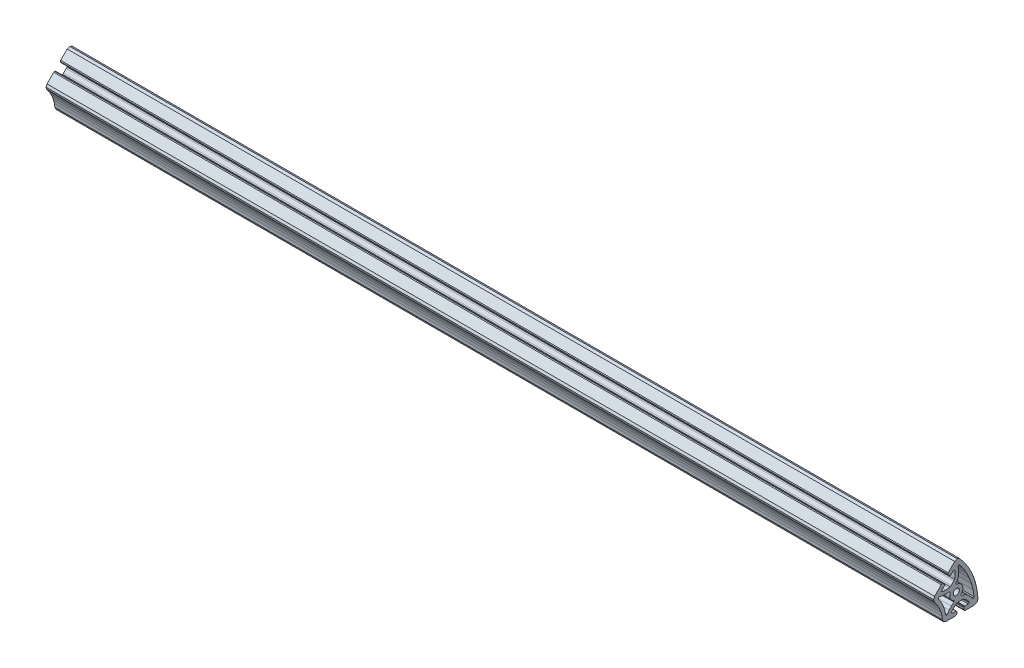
from build123d import *

# Parameters (mm, degrees)
MODEL_R                = 3.4
STRUKTURBAUTEIL1_DEPTH = 1000


with BuildPart() as part:
    # Model → Strukturbauteil1 (new body)
    with BuildSketch(Plane(origin=(0, 0, 0), x_dir=(0, 0, -1), z_dir=(1, 0, 0))):
        Polygon((-11.61496735, -22.961005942), (-0.932771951, -22.961005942), (0.127888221, -22.521666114), (0.567228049, -21.461005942), (0.567228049, -19.461005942), (0.274334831, -18.753899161), (-0.432771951, -18.461005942), (-4.348887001, -18.461005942), (-5.304706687, -17.888213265), (-5.191885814, -16.694075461), (-2.811566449, -13.924557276), (0.027227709, -11.471892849), (1.140569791, -10.905979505), (2.374171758, -10.711005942), (6.760284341, -10.711005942), (7.993886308, -10.905979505), (9.187622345, -11.531362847), (11.946022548, -13.924557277), (14.384752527, -16.775234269), (14.439162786, -17.888213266), (13.4833431, -18.461005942), (9.567228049, -18.461005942), (8.860121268, -18.753899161), (8.567228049, -19.461005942), (8.567228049, -21.461005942), (9.006567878, -22.521666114), (10.067228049, -22.961005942), (20.461891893, -22.961005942), (23.346534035, -21.732077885), (24.458667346, -18.800425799), (23.467468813, -9.741625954), (21.465987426, -0.902429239), (18.47759065, 7.653668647), (14.540631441, 15.816859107), (9.705636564, 23.482376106), (4.000980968, 30.58879811), (1.141592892, 31.875392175), (-1.76714049, 30.704625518), (-9.117277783, 23.354488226), (-9.556617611, 22.293828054), (-9.117277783, 21.233167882), (-7.70306422, 19.81895432), (-6.995957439, 19.526061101), (-6.288850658, 19.81895432), (-3.555094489, 22.552710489), (-2.415005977, 22.851377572), (-1.674240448, 21.93474748), (-1.399035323, 18.293262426), (-1.672070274, 14.551636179), (-2.059160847, 13.36422328), (-2.793582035, 12.354067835), (-5.895031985, 9.252617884), (-6.90518743, 8.518196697), (-8.092600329, 8.131106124), (-11.834226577, 7.858071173), (-15.574402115, 8.149361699), (-16.399870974, 8.897882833), (-16.129029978, 9.978775), (-13.35991847, 12.747886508), (-13.067025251, 13.454993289), (-13.35991847, 14.16210007), (-14.774132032, 15.576313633), (-15.834792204, 16.015653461), (-16.895452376, 15.576313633), (-24.448905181, 8.022860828), (-25.61511952, 5.401410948), (-24.694322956, 2.634848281), (-22.280144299, -0.58013733), (-20.200898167, -4.021231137), (-18.47759065, -7.653668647), (-17.127631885, -11.440752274), (-16.16466016, -15.34422208), (-15.59354756, -19.374405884), (-14.293250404, -21.931999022), align=None)
        Circle(MODEL_R, mode=Mode.SUBTRACT)
        with BuildLine():
            Line((-11.923429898, -16.408361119), (-12.597003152, -12.906309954))
            Line((-12.597003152, -12.906309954), (-13.551975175, -9.470310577))
            Line((-13.551975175, -9.470310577), (-14.78207252, -6.122934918))
            Line((-14.78207252, -6.122934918), (-16.279214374, -2.886172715))
            Line((-16.279214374, -2.886172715), (-18.03356564, 0.218712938))
            Line((-18.03356564, 0.218712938), (-20.092047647, 3.252458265))
            Line((-20.092047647, 3.252458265), (-20.088778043, 4.365155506))
            Line((-20.088778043, 4.365155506), (-18.961589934, 4.762322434))
            Line((-18.961589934, 4.762322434), (-15.338841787, 4.077694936))
            Line((-15.338841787, 4.077694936), (-11.658507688, 3.858241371))
            Line((-11.658507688, 3.858241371), (-7.880799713, 4.119485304))
            Line((-7.880799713, 4.119485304), (-7.008793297, 3.737176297))
            Line((-7.008793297, 3.737176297), (-6.888015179, 2.70467131))
            ThreePointArc((-6.888015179, 2.70467131), (-6.836708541, -2.8318574), (-2.958070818, -6.783053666))
            Line((-2.958070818, -6.783053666), (-2.313382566, -7.598547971))
            Line((-2.313382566, -7.598547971), (-2.659650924, -8.485482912))
            Line((-2.659650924, -8.485482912), (-5.515621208, -10.971998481))
            Line((-5.515621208, -10.971998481), (-7.962833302, -13.729564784))
            Line((-7.962833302, -13.729564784), (-10.092340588, -16.860782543))
            Line((-10.092340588, -16.860782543), (-11.118280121, -17.29154224))
            Line((-11.118280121, -17.29154224), (-11.923429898, -16.408361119))
        make_face(mode=Mode.SUBTRACT)
        with BuildLine():
            Line((6.158962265, -6.732227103), (5.237100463, -6.162274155))
            Line((5.237100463, -6.162274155), (5.443038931, -5.013314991))
            ThreePointArc((5.443038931, -5.013314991), (6.836708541, 2.8318574), (0.303860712, 7.393758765))
            Line((0.303860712, 7.393758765), (-0.654196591, 8.060575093))
            Line((-0.654196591, 8.060575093), (-0.405359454, 9.11544742))
            Line((-0.405359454, 9.11544742), (0.906982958, 10.559480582))
            Line((0.906982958, 10.559480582), (1.795003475, 12.184508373))
            Line((1.795003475, 12.184508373), (2.285600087, 13.970176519))
            Line((2.285600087, 13.970176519), (2.548573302, 16.491509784))
            Line((2.548573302, 16.491509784), (2.592794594, 18.926215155))
            Line((2.592794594, 18.926215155), (2.432599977, 21.356047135))
            Line((2.432599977, 21.356047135), (2.069118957, 23.763873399))
            Line((2.069118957, 23.763873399), (2.619353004, 24.912109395))
            Line((2.619353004, 24.912109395), (3.788245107, 24.669694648))
            Line((3.788245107, 24.669694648), (8.072127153, 18.789775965))
            Line((8.072127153, 18.789775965), (11.726402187, 12.61490345))
            Line((11.726402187, 12.61490345), (14.78207252, 6.122934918))
            Line((14.78207252, 6.122934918), (17.211902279, -0.628265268))
            Line((17.211902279, -0.628265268), (18.99423385, -7.578522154))
            Line((18.99423385, -7.578522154), (20.122802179, -14.765414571))
            Line((20.122802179, -14.765414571), (19.467683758, -15.763359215))
            Line((19.467683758, -15.763359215), (18.32353825, -15.422764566))
            Line((18.32353825, -15.422764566), (16.821113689, -13.380897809))
            Line((16.821113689, -13.380897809), (15.216237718, -11.549472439))
            Line((15.216237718, -11.549472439), (13.463371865, -9.859144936))
            Line((13.463371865, -9.859144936), (11.494569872, -8.26224323))
            Line((11.494569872, -8.26224323), (9.885007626, -7.346489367))
            Line((9.885007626, -7.346489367), (8.108014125, -6.825346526))
            Line((8.108014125, -6.825346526), (6.158962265, -6.732227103))
        make_face(mode=Mode.SUBTRACT)
    extrude(amount=STRUKTURBAUTEIL1_DEPTH)


solid = part.part
